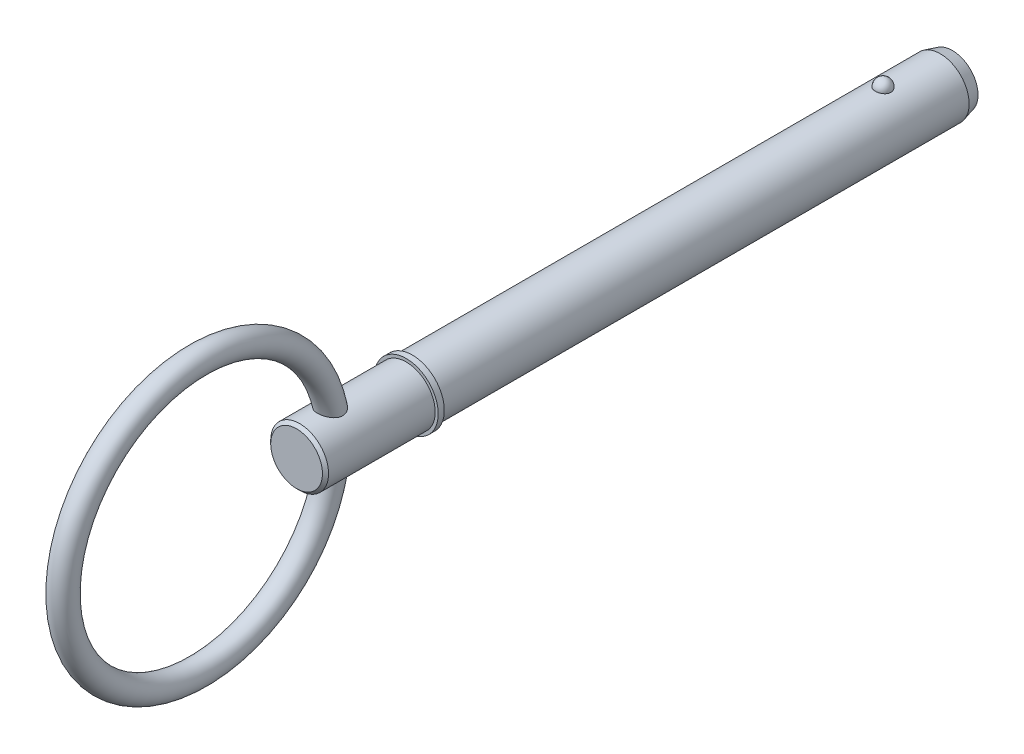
ISO-10303-21;
HEADER;
FILE_DESCRIPTION(('STEP AP214'),'2;1');
FILE_NAME('part.step','',(''),(''),'','','');
FILE_SCHEMA(('AUTOMOTIVE_DESIGN { 1 0 10303 214 1 1 1 1 }'));
ENDSEC;
DATA;
#1=APPLICATION_CONTEXT('core data for automotive mechanical design processes');
#2=APPLICATION_PROTOCOL_DEFINITION('international standard','automotive_design',2000,#1);
#3=PRODUCT_CONTEXT('',#1,'mechanical');
#4=PRODUCT('Part','Part','',(#3));
#5=PRODUCT_RELATED_PRODUCT_CATEGORY('part','',(#4));
#6=PRODUCT_DEFINITION_FORMATION('','',#4);
#7=PRODUCT_DEFINITION_CONTEXT('part definition',#1,'design');
#8=PRODUCT_DEFINITION('design','',#6,#7);
#9=PRODUCT_DEFINITION_SHAPE('','',#8);
#10=(LENGTH_UNIT() NAMED_UNIT(*) SI_UNIT(.MILLI.,.METRE.));
#11=(NAMED_UNIT(*) PLANE_ANGLE_UNIT() SI_UNIT($,.RADIAN.));
#12=(NAMED_UNIT(*) SI_UNIT($,.STERADIAN.) SOLID_ANGLE_UNIT());
#13=UNCERTAINTY_MEASURE_WITH_UNIT(LENGTH_MEASURE(1.E-05),#10,'distance_accuracy_value','');
#14=(GEOMETRIC_REPRESENTATION_CONTEXT(3) GLOBAL_UNCERTAINTY_ASSIGNED_CONTEXT((#13)) GLOBAL_UNIT_ASSIGNED_CONTEXT((#10,
#11,#12)) REPRESENTATION_CONTEXT('',''));
#15=CARTESIAN_POINT('',(0.,0.,0.));
#16=DIRECTION('',(0.,0.,1.));
#17=DIRECTION('',(1.,0.,0.));
#18=AXIS2_PLACEMENT_3D('',#15,#16,#17);
#19=CARTESIAN_POINT('',(0.,0.,76.2));
#20=DIRECTION('',(0.,0.,-1.));
#21=DIRECTION('',(-1.,0.,0.));
#22=AXIS2_PLACEMENT_3D('',#19,#20,#21);
#23=CYLINDRICAL_SURFACE('',#22,4.765);
#24=CARTESIAN_POINT('',(1.27812710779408,4.59038300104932,-1.29));
#25=CARTESIAN_POINT('',(1.27812572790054,4.59038414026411,-1.2178688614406));
#26=CARTESIAN_POINT('',(1.27223018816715,4.59203736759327,-1.14572000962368));
#27=CARTESIAN_POINT('',(1.24878929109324,4.59846646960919,-1.00346315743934));
#28=CARTESIAN_POINT('',(1.23123896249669,4.60324367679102,-0.933356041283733));
#29=CARTESIAN_POINT('',(1.18493861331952,4.61537801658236,-0.797215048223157));
#30=CARTESIAN_POINT('',(1.15619354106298,4.62273400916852,-0.73117938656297));
#31=CARTESIAN_POINT('',(1.08822596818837,4.6392032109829,-0.604986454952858));
#32=CARTESIAN_POINT('',(1.04900384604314,4.64831635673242,-0.544828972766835));
#33=CARTESIAN_POINT('',(0.960865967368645,4.66733302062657,-0.431775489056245));
#34=CARTESIAN_POINT('',(0.911906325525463,4.67723999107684,-0.378914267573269));
#35=CARTESIAN_POINT('',(0.805678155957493,4.69670280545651,-0.282245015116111));
#36=CARTESIAN_POINT('',(0.748409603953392,4.70625864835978,-0.238437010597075));
#37=CARTESIAN_POINT('',(0.627266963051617,4.72392767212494,-0.161207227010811));
#38=CARTESIAN_POINT('',(0.563411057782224,4.73204466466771,-0.127757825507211));
#39=CARTESIAN_POINT('',(0.430755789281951,4.74595788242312,-0.0720471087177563));
#40=CARTESIAN_POINT('',(0.361956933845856,4.75175434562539,-0.0497846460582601));
#41=CARTESIAN_POINT('',(0.222605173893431,4.76030056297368,-0.0173750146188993));
#42=CARTESIAN_POINT('',(0.152101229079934,4.76309991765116,-0.0070303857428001));
#43=CARTESIAN_POINT('',(0.0103009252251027,4.76551622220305,0.00191361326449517));
#44=CARTESIAN_POINT('',(-0.0609953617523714,4.76513345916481,0.000514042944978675));
#45=CARTESIAN_POINT('',(-0.201348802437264,4.76125496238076,-0.0138891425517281));
#46=CARTESIAN_POINT('',(-0.270423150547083,4.75780093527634,-0.0267372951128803));
#47=CARTESIAN_POINT('',(-0.405377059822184,4.74820737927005,-0.0634598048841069));
#48=CARTESIAN_POINT('',(-0.471256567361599,4.74206780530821,-0.0873343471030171));
#49=CARTESIAN_POINT('',(-0.598375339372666,4.72771507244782,-0.145611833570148));
#50=CARTESIAN_POINT('',(-0.659587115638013,4.71949070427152,-0.180071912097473));
#51=CARTESIAN_POINT('',(-0.775356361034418,4.70185936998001,-0.258542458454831));
#52=CARTESIAN_POINT('',(-0.829913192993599,4.69245229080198,-0.302553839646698));
#53=CARTESIAN_POINT('',(-0.931895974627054,4.67327936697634,-0.399829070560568));
#54=CARTESIAN_POINT('',(-0.979176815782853,4.66351011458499,-0.453244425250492));
#55=CARTESIAN_POINT('',(-1.06421220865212,4.64484426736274,-0.56732153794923));
#56=CARTESIAN_POINT('',(-1.10196613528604,4.63594772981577,-0.627983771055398));
#57=CARTESIAN_POINT('',(-1.16735225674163,4.61992036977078,-0.755585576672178));
#58=CARTESIAN_POINT('',(-1.19487251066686,4.61280933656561,-0.822585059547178));
#59=CARTESIAN_POINT('',(-1.23851975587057,4.60128324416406,-0.960417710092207));
#60=CARTESIAN_POINT('',(-1.25464705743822,4.59686811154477,-1.03125077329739));
#61=CARTESIAN_POINT('',(-1.27505790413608,4.59124882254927,-1.17443804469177));
#62=CARTESIAN_POINT('',(-1.27938868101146,4.59003186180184,-1.24678501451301));
#63=CARTESIAN_POINT('',(-1.27623192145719,4.5909105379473,-1.3911989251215));
#64=CARTESIAN_POINT('',(-1.26874468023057,4.59300609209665,-1.46326587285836));
#65=CARTESIAN_POINT('',(-1.24220427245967,4.60025423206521,-1.60473192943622));
#66=CARTESIAN_POINT('',(-1.2232043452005,4.60539274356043,-1.67414176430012));
#67=CARTESIAN_POINT('',(-1.17415910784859,4.61813957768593,-1.80870154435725));
#68=CARTESIAN_POINT('',(-1.1441133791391,4.62574799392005,-1.87385132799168));
#69=CARTESIAN_POINT('',(-1.07354327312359,4.64263368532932,-1.99841604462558));
#70=CARTESIAN_POINT('',(-1.03296580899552,4.65191934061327,-2.05779976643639));
#71=CARTESIAN_POINT('',(-0.942433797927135,4.67110036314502,-2.16881966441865));
#72=CARTESIAN_POINT('',(-0.892478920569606,4.68099575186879,-2.22045556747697));
#73=CARTESIAN_POINT('',(-0.784302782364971,4.70033161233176,-2.31471696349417));
#74=CARTESIAN_POINT('',(-0.726054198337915,4.70977043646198,-2.35731146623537));
#75=CARTESIAN_POINT('',(-0.602997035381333,4.72709995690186,-2.43206620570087));
#76=CARTESIAN_POINT('',(-0.538188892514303,4.73499075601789,-2.46422713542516));
#77=CARTESIAN_POINT('',(-0.404639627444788,4.7482563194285,-2.51687454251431));
#78=CARTESIAN_POINT('',(-0.33595386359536,4.7536596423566,-2.53749415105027));
#79=CARTESIAN_POINT('',(-0.195948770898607,4.76148510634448,-2.56703727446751));
#80=CARTESIAN_POINT('',(-0.124629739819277,4.76390758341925,-2.57596210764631));
#81=CARTESIAN_POINT('',(0.0172696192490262,4.76548774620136,-2.58180339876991));
#82=CARTESIAN_POINT('',(0.0878407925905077,4.76470225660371,-2.57892886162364));
#83=CARTESIAN_POINT('',(0.227467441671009,4.76008019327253,-2.56172603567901));
#84=CARTESIAN_POINT('',(0.296522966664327,4.75624371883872,-2.54739811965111));
#85=CARTESIAN_POINT('',(0.430942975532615,4.74595041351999,-2.50776251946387));
#86=CARTESIAN_POINT('',(0.496319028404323,4.7395023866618,-2.4824917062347));
#87=CARTESIAN_POINT('',(0.621860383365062,4.72467083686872,-2.4216730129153));
#88=CARTESIAN_POINT('',(0.682025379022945,4.71628720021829,-2.38612452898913));
#89=CARTESIAN_POINT('',(0.796409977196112,4.69833598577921,-2.30511163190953));
#90=CARTESIAN_POINT('',(0.850529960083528,4.68875291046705,-2.25951003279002));
#91=CARTESIAN_POINT('',(0.950412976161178,4.66953243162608,-2.15992428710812));
#92=CARTESIAN_POINT('',(0.996174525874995,4.65989501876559,-2.10593865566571));
#93=CARTESIAN_POINT('',(1.07885962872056,4.64145616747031,-1.99009376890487));
#94=CARTESIAN_POINT('',(1.11562789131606,4.63267081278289,-1.92812106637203));
#95=CARTESIAN_POINT('',(1.17840570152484,4.61710269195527,-1.79873681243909));
#96=CARTESIAN_POINT('',(1.20441973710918,4.61031909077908,-1.73132754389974));
#97=CARTESIAN_POINT('',(1.24242116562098,4.60021170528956,-1.60192906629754));
#98=CARTESIAN_POINT('',(1.25578772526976,4.59655387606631,-1.54036674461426));
#99=CARTESIAN_POINT('',(1.27364121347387,4.59163904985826,-1.41587409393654));
#100=CARTESIAN_POINT('',(1.2781283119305,4.59038200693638,-1.35294379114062));
#101=CARTESIAN_POINT('',(1.27812710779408,4.59038300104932,-1.29));
#102=B_SPLINE_CURVE_WITH_KNOTS('',3,(#24,#25,#26,#27,#28,#29,#30,#31,#32,#33,#34,#35,#36,#37,
#38,#39,#40,#41,#42,#43,#44,#45,#46,#47,#48,#49,#50,#51,#52,#53,#54,#55,#56,#57,#58,#59,#60,#61,
#62,#63,#64,#65,#66,#67,#68,#69,#70,#71,#72,#73,#74,#75,#76,#77,#78,#79,#80,#81,#82,#83,#84,#85,
#86,#87,#88,#89,#90,#91,#92,#93,#94,#95,#96,#97,#98,#99,#100,#101),.UNSPECIFIED.,.T.,.F.,(4,2,2,
2,2,2,2,2,2,2,2,2,2,2,2,2,2,2,2,2,2,2,2,2,2,2,2,2,2,2,2,2,2,2,2,2,2,2,4),(0.,0.216167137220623,
0.432426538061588,0.648590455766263,0.864746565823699,1.0818998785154,1.29905382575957,
1.51562361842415,1.73217119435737,1.94507683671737,2.15796327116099,2.36800220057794,
2.57804465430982,2.78924132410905,3.00045819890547,3.21545551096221,3.43046692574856,
3.64776550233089,3.8650581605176,4.08147951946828,4.29789547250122,4.51331818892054,
4.72874907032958,4.94528769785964,5.16183395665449,5.37911087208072,5.59637335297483,
5.8110751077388,6.02575265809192,6.23664413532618,6.44752874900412,6.65770827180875,
6.86790014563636,7.08116060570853,7.29445887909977,7.51121476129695,7.72788009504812,
7.91651762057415,8.10515153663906),.UNSPECIFIED.);
#103=CARTESIAN_POINT('',(1.27812710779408,4.59038300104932,-1.29));
#104=VERTEX_POINT('',#103);
#105=EDGE_CURVE('E101',#104,#104,#102,.T.);
#106=ORIENTED_EDGE('',*,*,#105,.T.);
#107=EDGE_LOOP('',(#106));
#108=FACE_BOUND('',#107,.T.);
#109=CARTESIAN_POINT('',(0.,0.,-10.7));
#110=DIRECTION('',(0.,0.,-1.));
#111=DIRECTION('',(-1.,0.,0.));
#112=AXIS2_PLACEMENT_3D('',#109,#110,#111);
#113=CIRCLE('',#112,4.765);
#114=CARTESIAN_POINT('',(-4.765,0.,-10.7));
#115=VERTEX_POINT('',#114);
#116=EDGE_CURVE('E109',#115,#115,#113,.F.);
#117=ORIENTED_EDGE('',*,*,#116,.T.);
#118=EDGE_LOOP('',(#117));
#119=FACE_BOUND('',#118,.T.);
#120=CARTESIAN_POINT('',(0.,0.,76.2));
#121=DIRECTION('',(0.,0.,1.));
#122=DIRECTION('',(1.,0.,0.));
#123=AXIS2_PLACEMENT_3D('',#120,#121,#122);
#124=CIRCLE('',#123,4.765);
#125=CARTESIAN_POINT('',(4.765,0.,76.2));
#126=VERTEX_POINT('',#125);
#127=EDGE_CURVE('E107',#126,#126,#124,.T.);
#128=ORIENTED_EDGE('',*,*,#127,.F.);
#129=EDGE_LOOP('',(#128));
#130=FACE_BOUND('',#129,.T.);
#131=ADVANCED_FACE('F39',(#108,#119,#130),#23,.T.);
#132=CARTESIAN_POINT('',(0.,0.,-12.7));
#133=DIRECTION('',(0.,0.,-1.));
#134=DIRECTION('',(-1.,0.,0.));
#135=AXIS2_PLACEMENT_3D('',#132,#133,#134);
#136=PLANE('',#135);
#137=CARTESIAN_POINT('',(0.,0.,-12.7));
#138=DIRECTION('',(0.,0.,-1.));
#139=DIRECTION('',(-1.,0.,0.));
#140=AXIS2_PLACEMENT_3D('',#137,#138,#139);
#141=CIRCLE('',#140,4.22910161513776);
#142=CARTESIAN_POINT('',(-4.22910161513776,0.,-12.7));
#143=VERTEX_POINT('',#142);
#144=EDGE_CURVE('E143',#143,#143,#141,.T.);
#145=ORIENTED_EDGE('',*,*,#144,.T.);
#146=EDGE_LOOP('',(#145));
#147=FACE_BOUND('',#146,.T.);
#148=ADVANCED_FACE('F87',(#147),#136,.T.);
#149=CARTESIAN_POINT('',(0.,0.,-12.7));
#150=DIRECTION('',(0.,0.,1.));
#151=DIRECTION('',(1.,0.,0.));
#152=AXIS2_PLACEMENT_3D('',#149,#150,#151);
#153=CONICAL_SURFACE('',#152,4.22910161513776,0.261799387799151);
#154=ORIENTED_EDGE('',*,*,#116,.F.);
#155=EDGE_LOOP('',(#154));
#156=FACE_BOUND('',#155,.T.);
#157=ORIENTED_EDGE('',*,*,#144,.F.);
#158=EDGE_LOOP('',(#157));
#159=FACE_BOUND('',#158,.T.);
#160=ADVANCED_FACE('F93',(#156,#159),#153,.T.);
#161=CARTESIAN_POINT('',(0.,4.765,-1.29));
#162=DIRECTION('',(0.,1.,0.));
#163=DIRECTION('',(0.,0.,-1.));
#164=AXIS2_PLACEMENT_3D('',#161,#162,#163);
#165=SPHERICAL_SURFACE('',#164,1.29);
#166=ORIENTED_EDGE('',*,*,#105,.F.);
#167=EDGE_LOOP('',(#166));
#168=FACE_BOUND('',#167,.T.);
#169=ADVANCED_FACE('F112',(#168),#165,.T.);
#170=CARTESIAN_POINT('',(0.,0.,76.2));
#171=DIRECTION('',(0.,0.,-1.));
#172=DIRECTION('',(-1.,0.,0.));
#173=AXIS2_PLACEMENT_3D('',#170,#171,#172);
#174=PLANE('',#173);
#175=ORIENTED_EDGE('',*,*,#127,.T.);
#176=EDGE_LOOP('',(#175));
#177=FACE_BOUND('',#176,.T.);
#178=CARTESIAN_POINT('',(0.,0.,76.2));
#179=DIRECTION('',(0.,0.,-1.));
#180=DIRECTION('',(-1.,0.,0.));
#181=AXIS2_PLACEMENT_3D('',#178,#179,#180);
#182=CIRCLE('',#181,5.265);
#183=CARTESIAN_POINT('',(-5.265,0.,76.2));
#184=VERTEX_POINT('',#183);
#185=EDGE_CURVE('E108',#184,#184,#182,.T.);
#186=ORIENTED_EDGE('',*,*,#185,.T.);
#187=EDGE_LOOP('',(#186));
#188=FACE_BOUND('',#187,.T.);
#189=ADVANCED_FACE('F116',(#177,#188),#174,.T.);
#190=CARTESIAN_POINT('',(0.,0.,33.7287874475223));
#191=DIRECTION('',(0.,0.,-1.));
#192=DIRECTION('',(-1.,0.,0.));
#193=AXIS2_PLACEMENT_3D('',#190,#191,#192);
#194=CYLINDRICAL_SURFACE('',#193,5.265);
#195=CARTESIAN_POINT('',(0.,0.,77.2));
#196=DIRECTION('',(0.,0.,-1.));
#197=DIRECTION('',(-1.,0.,0.));
#198=AXIS2_PLACEMENT_3D('',#195,#196,#197);
#199=CIRCLE('',#198,5.265);
#200=CARTESIAN_POINT('',(-5.265,0.,77.2));
#201=VERTEX_POINT('',#200);
#202=EDGE_CURVE('E133',#201,#201,#199,.T.);
#203=ORIENTED_EDGE('',*,*,#202,.T.);
#204=EDGE_LOOP('',(#203));
#205=FACE_BOUND('',#204,.T.);
#206=ORIENTED_EDGE('',*,*,#185,.F.);
#207=EDGE_LOOP('',(#206));
#208=FACE_BOUND('',#207,.T.);
#209=ADVANCED_FACE('F120',(#205,#208),#194,.T.);
#210=CARTESIAN_POINT('',(0.,5.265,77.2));
#211=DIRECTION('',(0.,0.,1.));
#212=DIRECTION('',(1.,0.,0.));
#213=AXIS2_PLACEMENT_3D('',#210,#211,#212);
#214=PLANE('',#213);
#215=CARTESIAN_POINT('',(0.,0.,77.2));
#216=DIRECTION('',(0.,0.,1.));
#217=DIRECTION('',(1.,0.,0.));
#218=AXIS2_PLACEMENT_3D('',#215,#216,#217);
#219=CIRCLE('',#218,4.765);
#220=CARTESIAN_POINT('',(4.765,0.,77.2));
#221=VERTEX_POINT('',#220);
#222=EDGE_CURVE('E111',#221,#221,#219,.T.);
#223=ORIENTED_EDGE('',*,*,#222,.F.);
#224=EDGE_LOOP('',(#223));
#225=FACE_BOUND('',#224,.T.);
#226=ORIENTED_EDGE('',*,*,#202,.F.);
#227=EDGE_LOOP('',(#226));
#228=FACE_BOUND('',#227,.T.);
#229=ADVANCED_FACE('F84',(#225,#228),#214,.T.);
#230=CARTESIAN_POINT('',(0.,0.,95.25));
#231=DIRECTION('',(0.,0.,-1.));
#232=DIRECTION('',(-1.,0.,0.));
#233=AXIS2_PLACEMENT_3D('',#230,#231,#232);
#234=CYLINDRICAL_SURFACE('',#233,4.765);
#235=CARTESIAN_POINT('',(-1.17603588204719,-4.61759294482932,88.0837200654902));
#236=CARTESIAN_POINT('',(-1.08605054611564,-4.6405075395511,88.0215688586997));
#237=CARTESIAN_POINT('',(-0.990486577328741,-4.66202408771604,87.9667393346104));
#238=CARTESIAN_POINT('',(-0.79076273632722,-4.70002969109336,87.8729957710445));
#239=CARTESIAN_POINT('',(-0.686587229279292,-4.7165093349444,87.8341114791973));
#240=CARTESIAN_POINT('',(-0.472539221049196,-4.7427361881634,87.773267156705));
#241=CARTESIAN_POINT('',(-0.362665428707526,-4.7524818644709,87.7513109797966));
#242=CARTESIAN_POINT('',(-0.140482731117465,-4.7642267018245,87.7249366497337));
#243=CARTESIAN_POINT('',(-0.0281752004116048,-4.7662301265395,87.7205088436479));
#244=CARTESIAN_POINT('',(0.193745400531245,-4.76233166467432,87.7292082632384));
#245=CARTESIAN_POINT('',(0.303372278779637,-4.75656024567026,87.7420457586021));
#246=CARTESIAN_POINT('',(0.518724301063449,-4.73791484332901,87.7844340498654));
#247=CARTESIAN_POINT('',(0.624448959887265,-4.72503997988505,87.8139869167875));
#248=CARTESIAN_POINT('',(0.829434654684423,-4.69340588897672,87.8892085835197));
#249=CARTESIAN_POINT('',(0.928674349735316,-4.6746283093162,87.9349277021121));
#250=CARTESIAN_POINT('',(1.11777413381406,-4.6330539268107,88.0414733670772));
#251=CARTESIAN_POINT('',(1.20763216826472,-4.61025624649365,88.1023032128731));
#252=CARTESIAN_POINT('',(1.37762760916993,-4.56238439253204,88.2394393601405));
#253=CARTESIAN_POINT('',(1.45749020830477,-4.53726959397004,88.3160728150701));
#254=CARTESIAN_POINT('',(1.60275140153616,-4.48801828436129,88.4822939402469));
#255=CARTESIAN_POINT('',(1.66815155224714,-4.46388166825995,88.571880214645));
#256=CARTESIAN_POINT('',(1.78162069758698,-4.41980966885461,88.7604689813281));
#257=CARTESIAN_POINT('',(1.82993675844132,-4.3998162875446,88.8593086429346));
#258=CARTESIAN_POINT('',(1.90902953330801,-4.36608532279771,89.0647395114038));
#259=CARTESIAN_POINT('',(1.93981696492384,-4.35234391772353,89.1713259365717));
#260=CARTESIAN_POINT('',(1.9818112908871,-4.33337618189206,89.382380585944));
#261=CARTESIAN_POINT('',(1.99406945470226,-4.32769391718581,89.48660066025));
#262=CARTESIAN_POINT('',(2.0025484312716,-4.32377679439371,89.6958125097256));
#263=CARTESIAN_POINT('',(1.99876733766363,-4.32554282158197,89.8008043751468));
#264=CARTESIAN_POINT('',(1.97595504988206,-4.33600911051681,90.0091056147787));
#265=CARTESIAN_POINT('',(1.95686739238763,-4.3447350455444,90.1124073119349));
#266=CARTESIAN_POINT('',(1.90457346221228,-4.36790947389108,90.3146792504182));
#267=CARTESIAN_POINT('',(1.87136191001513,-4.38236010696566,90.4136478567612));
#268=CARTESIAN_POINT('',(1.78747856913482,-4.41728816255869,90.6164706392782));
#269=CARTESIAN_POINT('',(1.73524632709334,-4.43826528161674,90.7195927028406));
#270=CARTESIAN_POINT('',(1.61607256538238,-4.48303292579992,90.9163865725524));
#271=CARTESIAN_POINT('',(1.5491157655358,-4.50682636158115,91.0100484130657));
#272=CARTESIAN_POINT('',(1.39359064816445,-4.55746895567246,91.1953838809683));
#273=CARTESIAN_POINT('',(1.30346928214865,-4.58437060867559,91.2857503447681));
#274=CARTESIAN_POINT('',(1.10794390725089,-4.6354985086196,91.4490111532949));
#275=CARTESIAN_POINT('',(1.00255934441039,-4.65972809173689,91.5219274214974));
#276=CARTESIAN_POINT('',(0.803761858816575,-4.69755503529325,91.6324077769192));
#277=CARTESIAN_POINT('',(0.712935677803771,-4.71231838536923,91.6742306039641));
#278=CARTESIAN_POINT('',(0.525172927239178,-4.73691370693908,91.7429362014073));
#279=CARTESIAN_POINT('',(0.428242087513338,-4.74675022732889,91.7698327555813));
#280=CARTESIAN_POINT('',(0.230351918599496,-4.76046566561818,91.8071470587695));
#281=CARTESIAN_POINT('',(0.129376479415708,-4.76431768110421,91.8174904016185));
#282=CARTESIAN_POINT('',(-0.0728965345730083,-4.76551495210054,91.8207168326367));
#283=CARTESIAN_POINT('',(-0.174194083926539,-4.76286070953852,91.8136012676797));
#284=CARTESIAN_POINT('',(-0.366467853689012,-4.751792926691,91.7835798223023));
#285=CARTESIAN_POINT('',(-0.457659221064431,-4.74381187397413,91.7618588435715));
#286=CARTESIAN_POINT('',(-0.635226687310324,-4.72331548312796,91.7050844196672));
#287=CARTESIAN_POINT('',(-0.72160169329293,-4.71079912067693,91.6700279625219));
#288=CARTESIAN_POINT('',(-0.893212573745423,-4.68139468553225,91.5855597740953));
#289=CARTESIAN_POINT('',(-0.978027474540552,-4.66427939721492,91.5353775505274));
#290=CARTESIAN_POINT('',(-1.13917803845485,-4.62756330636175,91.4236420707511));
#291=CARTESIAN_POINT('',(-1.21550961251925,-4.60796131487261,91.3620833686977));
#292=CARTESIAN_POINT('',(-1.37033540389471,-4.56452178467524,91.2186885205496));
#293=CARTESIAN_POINT('',(-1.44723650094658,-4.5405070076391,91.1351843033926));
#294=CARTESIAN_POINT('',(-1.58763850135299,-4.49334232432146,90.9572920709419));
#295=CARTESIAN_POINT('',(-1.65112672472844,-4.47019325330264,90.8628938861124));
#296=CARTESIAN_POINT('',(-1.77033243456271,-4.42444393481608,90.6532060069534));
#297=CARTESIAN_POINT('',(-1.82420433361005,-4.40224259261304,90.5367685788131));
#298=CARTESIAN_POINT('',(-1.9116908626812,-4.36496831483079,90.2954090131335));
#299=CARTESIAN_POINT('',(-1.94531523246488,-4.3498919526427,90.1704909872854));
#300=CARTESIAN_POINT('',(-1.98892523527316,-4.33012255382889,89.9220163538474));
#301=CARTESIAN_POINT('',(-1.99998275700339,-4.32495941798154,89.7986899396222));
#302=CARTESIAN_POINT('',(-2.00001713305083,-4.32494814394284,89.552073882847));
#303=CARTESIAN_POINT('',(-1.98902141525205,-4.33008719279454,89.4287843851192));
#304=CARTESIAN_POINT('',(-1.94752572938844,-4.34888267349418,89.20321378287));
#305=CARTESIAN_POINT('',(-1.91979754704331,-4.36132278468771,89.1003106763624));
#306=CARTESIAN_POINT('',(-1.8480559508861,-4.39220107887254,88.9012512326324));
#307=CARTESIAN_POINT('',(-1.80403476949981,-4.4106421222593,88.8050981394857));
#308=CARTESIAN_POINT('',(-1.7023200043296,-4.4508689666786,88.6244579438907));
#309=CARTESIAN_POINT('',(-1.64499853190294,-4.47255887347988,88.5397380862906));
#310=CARTESIAN_POINT('',(-1.51770958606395,-4.51733419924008,88.381012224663));
#311=CARTESIAN_POINT('',(-1.44776268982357,-4.54041730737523,88.3069891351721));
#312=CARTESIAN_POINT('',(-1.34143544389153,-4.57239833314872,88.21104340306));
#313=CARTESIAN_POINT('',(-1.30955259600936,-4.58164274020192,88.1841153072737));
#314=CARTESIAN_POINT('',(-1.24406394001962,-4.59985727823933,88.1323409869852));
#315=CARTESIAN_POINT('',(-1.21045807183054,-4.6088273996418,88.1074948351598));
#316=CARTESIAN_POINT('',(-1.17603588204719,-4.61759294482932,88.0837200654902));
#317=B_SPLINE_CURVE_WITH_KNOTS('',3,(#235,#236,#237,#238,#239,#240,#241,#242,#243,#244,#245,
#246,#247,#248,#249,#250,#251,#252,#253,#254,#255,#256,#257,#258,#259,#260,#261,#262,#263,#264,
#265,#266,#267,#268,#269,#270,#271,#272,#273,#274,#275,#276,#277,#278,#279,#280,#281,#282,#283,
#284,#285,#286,#287,#288,#289,#290,#291,#292,#293,#294,#295,#296,#297,#298,#299,#300,#301,#302,
#303,#304,#305,#306,#307,#308,#309,#310,#311,#312,#313,#314,#315,#316),.UNSPECIFIED.,.T.,.F.,(4,
2,2,2,2,2,2,2,2,2,2,2,2,2,2,2,2,2,2,2,2,2,2,2,2,2,2,2,2,2,2,2,2,2,2,2,2,2,2,2,4),(0.,
0.335054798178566,0.670731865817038,1.00648532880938,1.3420538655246,1.67206089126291,
2.00210881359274,2.33319321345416,2.66434996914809,3.00321157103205,3.34203668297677,
3.67573940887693,4.00923787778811,4.32299322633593,4.63678586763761,4.95174139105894,
5.26681474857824,5.61785759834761,5.96926647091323,6.35862694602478,6.74749565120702,
7.04947204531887,7.35116911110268,7.65421852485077,7.95724456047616,8.23825252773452,
8.51932400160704,8.81825171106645,9.11732288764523,9.46404422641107,9.81109188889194,
10.1997682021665,10.5882573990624,10.9578189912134,11.32692124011,11.6472091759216,
11.9676500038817,12.2800235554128,12.5918925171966,12.7200569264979,12.8482258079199),.UNSPECIFIED.);
#318=CARTESIAN_POINT('',(-1.17603588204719,-4.61759294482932,88.0837200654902));
#319=VERTEX_POINT('',#318);
#320=EDGE_CURVE('E10',#319,#319,#317,.T.);
#321=ORIENTED_EDGE('',*,*,#320,.F.);
#322=EDGE_LOOP('',(#321));
#323=FACE_BOUND('',#322,.T.);
#324=CARTESIAN_POINT('',(-1.17603588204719,4.61759294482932,88.0837200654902));
#325=CARTESIAN_POINT('',(-1.26499234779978,4.59493450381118,88.1451699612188));
#326=CARTESIAN_POINT('',(-1.34870034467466,4.57085993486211,88.2139152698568));
#327=CARTESIAN_POINT('',(-1.50334626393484,4.52236448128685,88.364635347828));
#328=CARTESIAN_POINT('',(-1.57425996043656,4.49794303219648,88.4466346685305));
#329=CARTESIAN_POINT('',(-1.7013018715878,4.45144771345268,88.6222345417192));
#330=CARTESIAN_POINT('',(-1.75740699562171,4.42937754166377,88.7158528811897));
#331=CARTESIAN_POINT('',(-1.85287755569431,4.39030189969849,88.9121668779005));
#332=CARTESIAN_POINT('',(-1.89225871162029,4.37329167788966,89.0148539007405));
#333=CARTESIAN_POINT('',(-1.95188661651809,4.34699775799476,89.2218576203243));
#334=CARTESIAN_POINT('',(-1.97286468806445,4.33742068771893,89.3259265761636));
#335=CARTESIAN_POINT('',(-1.99814509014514,4.32583397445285,89.5364714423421));
#336=CARTESIAN_POINT('',(-2.00244696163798,4.32382453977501,89.6429474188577));
#337=CARTESIAN_POINT('',(-1.99499900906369,4.32726361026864,89.8527706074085));
#338=CARTESIAN_POINT('',(-1.9836061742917,4.33254625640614,89.956134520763));
#339=CARTESIAN_POINT('',(-1.94643618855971,4.34936983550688,90.1596911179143));
#340=CARTESIAN_POINT('',(-1.92065444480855,4.3609127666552,90.2598827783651));
#341=CARTESIAN_POINT('',(-1.85292379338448,4.3901452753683,90.4641042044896));
#342=CARTESIAN_POINT('',(-1.80971134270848,4.40830066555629,90.5676462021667));
#343=CARTESIAN_POINT('',(-1.70892742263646,4.44833985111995,90.7667684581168));
#344=CARTESIAN_POINT('',(-1.65134284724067,4.47022704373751,90.8623413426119));
#345=CARTESIAN_POINT('',(-1.51475300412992,4.51847764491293,91.0552600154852));
#346=CARTESIAN_POINT('',(-1.43395667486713,4.54505660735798,91.1512914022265));
#347=CARTESIAN_POINT('',(-1.25684082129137,4.59718102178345,91.3281328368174));
#348=CARTESIAN_POINT('',(-1.16053129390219,4.62272712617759,91.4089526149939));
#349=CARTESIAN_POINT('',(-0.972192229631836,4.66558476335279,91.5393265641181));
#350=CARTESIAN_POINT('',(-0.882391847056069,4.68355428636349,91.5918799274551));
#351=CARTESIAN_POINT('',(-0.694836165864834,4.71502283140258,91.6820221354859));
#352=CARTESIAN_POINT('',(-0.597087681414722,4.72852563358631,91.7196236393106));
#353=CARTESIAN_POINT('',(-0.39532174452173,4.74966109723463,91.7778751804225));
#354=CARTESIAN_POINT('',(-0.291269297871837,4.7572569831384,91.7984190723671));
#355=CARTESIAN_POINT('',(-0.0808979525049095,4.76547327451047,91.8206246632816));
#356=CARTESIAN_POINT('',(0.0254198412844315,4.76609700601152,91.8222953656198));
#357=CARTESIAN_POINT('',(0.225327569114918,4.7606097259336,91.8074850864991));
#358=CARTESIAN_POINT('',(0.319084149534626,4.75519734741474,91.7928871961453));
#359=CARTESIAN_POINT('',(0.502750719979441,4.73930039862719,91.7493972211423));
#360=CARTESIAN_POINT('',(0.592660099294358,4.7288150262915,91.720502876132));
#361=CARTESIAN_POINT('',(0.7687773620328,4.70343779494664,91.6490413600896));
#362=CARTESIAN_POINT('',(0.854839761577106,4.68844387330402,91.6061552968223));
#363=CARTESIAN_POINT('',(1.01943666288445,4.65543047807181,91.5087469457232));
#364=CARTESIAN_POINT('',(1.09796821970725,4.63740982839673,91.4542201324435));
#365=CARTESIAN_POINT('',(1.25751825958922,4.59691257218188,91.3264656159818));
#366=CARTESIAN_POINT('',(1.33721103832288,4.57417011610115,91.2516678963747));
#367=CARTESIAN_POINT('',(1.48461190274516,4.52847869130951,91.0910829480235));
#368=CARTESIAN_POINT('',(1.55230949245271,4.50552956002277,91.0052862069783));
#369=CARTESIAN_POINT('',(1.68366050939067,4.45825797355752,90.8114045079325));
#370=CARTESIAN_POINT('',(1.74532014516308,4.43421533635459,90.7018899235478));
#371=CARTESIAN_POINT('',(1.85007805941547,4.39154308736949,90.4732696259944));
#372=CARTESIAN_POINT('',(1.89317429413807,4.37291407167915,90.3541628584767));
#373=CARTESIAN_POINT('',(1.958572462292,4.34402041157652,90.1097631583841));
#374=CARTESIAN_POINT('',(1.98095022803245,4.33372528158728,89.984494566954));
#375=CARTESIAN_POINT('',(2.00301292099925,4.32358016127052,89.7315942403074));
#376=CARTESIAN_POINT('',(2.00273000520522,4.32371536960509,89.6039661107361));
#377=CARTESIAN_POINT('',(1.97997568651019,4.3341693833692,89.3682474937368));
#378=CARTESIAN_POINT('',(1.96044562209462,4.34313814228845,89.2598066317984));
#379=CARTESIAN_POINT('',(1.90368145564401,4.36831534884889,89.0485431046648));
#380=CARTESIAN_POINT('',(1.86644884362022,4.38452318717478,88.9457199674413));
#381=CARTESIAN_POINT('',(1.7781154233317,4.42104679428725,88.7547100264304));
#382=CARTESIAN_POINT('',(1.72797707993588,4.44105894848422,88.6660156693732));
#383=CARTESIAN_POINT('',(1.61439500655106,4.48359504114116,88.4982868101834));
#384=CARTESIAN_POINT('',(1.55094927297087,4.50611935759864,88.4192537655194));
#385=CARTESIAN_POINT('',(1.40889349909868,4.55259151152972,88.2687053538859));
#386=CARTESIAN_POINT('',(1.32968750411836,4.57655455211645,88.1977571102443));
#387=CARTESIAN_POINT('',(1.16035884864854,4.62238936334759,88.0695060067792));
#388=CARTESIAN_POINT('',(1.07023361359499,4.64426063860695,88.0122063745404));
#389=CARTESIAN_POINT('',(0.877362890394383,4.68460759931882,87.9103166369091));
#390=CARTESIAN_POINT('',(0.774249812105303,4.70290564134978,87.8663495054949));
#391=CARTESIAN_POINT('',(0.561430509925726,4.73302876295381,87.7954843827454));
#392=CARTESIAN_POINT('',(0.451725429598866,4.74485496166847,87.7685834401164));
#393=CARTESIAN_POINT('',(0.230282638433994,4.76071009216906,87.7327633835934));
#394=CARTESIAN_POINT('',(0.118587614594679,4.76483485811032,87.7236232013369));
#395=CARTESIAN_POINT('',(-0.104911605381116,4.76515532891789,87.7229082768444));
#396=CARTESIAN_POINT('',(-0.216715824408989,4.76134861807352,87.7313388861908));
#397=CARTESIAN_POINT('',(-0.435231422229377,4.74632552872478,87.7652456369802));
#398=CARTESIAN_POINT('',(-0.541996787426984,4.73523460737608,87.7904332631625));
#399=CARTESIAN_POINT('',(-0.749371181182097,4.70686626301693,87.8569215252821));
#400=CARTESIAN_POINT('',(-0.849990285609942,4.68959930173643,87.8981949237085));
#401=CARTESIAN_POINT('',(-0.986108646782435,4.6620261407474,87.9672359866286));
#402=CARTESIAN_POINT('',(-1.02525769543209,4.65355983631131,87.9887724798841));
#403=CARTESIAN_POINT('',(-1.10191286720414,4.63600664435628,88.0343673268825));
#404=CARTESIAN_POINT('',(-1.13941901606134,4.62691976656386,88.058425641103));
#405=CARTESIAN_POINT('',(-1.17603588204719,4.61759294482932,88.0837200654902));
#406=B_SPLINE_CURVE_WITH_KNOTS('',3,(#324,#325,#326,#327,#328,#329,#330,#331,#332,#333,#334,
#335,#336,#337,#338,#339,#340,#341,#342,#343,#344,#345,#346,#347,#348,#349,#350,#351,#352,#353,
#354,#355,#356,#357,#358,#359,#360,#361,#362,#363,#364,#365,#366,#367,#368,#369,#370,#371,#372,
#373,#374,#375,#376,#377,#378,#379,#380,#381,#382,#383,#384,#385,#386,#387,#388,#389,#390,#391,
#392,#393,#394,#395,#396,#397,#398,#399,#400,#401,#402,#403,#404,#405),.UNSPECIFIED.,.T.,.F.,(4,
2,2,2,2,2,2,2,2,2,2,2,2,2,2,2,2,2,2,2,2,2,2,2,2,2,2,2,2,2,2,2,2,2,2,2,2,2,2,2,4),(0.,
0.331234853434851,0.66309046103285,0.995460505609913,1.3275174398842,1.64568783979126,
1.96386699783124,2.27492717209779,2.5860866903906,2.92571998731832,3.26566413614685,
3.64875195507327,4.03159388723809,4.34706664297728,4.66227172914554,4.97942386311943,
5.29642469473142,5.58021908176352,5.86405835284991,6.15488068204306,6.44581627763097,
6.77943874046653,7.11335170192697,7.49545660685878,7.87760356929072,8.25834622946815,
8.63854860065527,8.96843568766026,9.29829501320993,9.60842872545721,9.91860916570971,
10.2441707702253,10.5698092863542,10.9089029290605,11.2479379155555,11.5827251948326,
11.9176144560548,12.2468820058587,12.5755944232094,12.7119417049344,12.8482868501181),.UNSPECIFIED.);
#407=CARTESIAN_POINT('',(-1.17603588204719,4.61759294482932,88.0837200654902));
#408=VERTEX_POINT('',#407);
#409=EDGE_CURVE('E51',#408,#408,#406,.T.);
#410=ORIENTED_EDGE('',*,*,#409,.F.);
#411=EDGE_LOOP('',(#410));
#412=FACE_BOUND('',#411,.T.);
#413=CARTESIAN_POINT('',(0.,0.,94.7499999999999));
#414=DIRECTION('',(0.,0.,-1.));
#415=DIRECTION('',(-1.,0.,0.));
#416=AXIS2_PLACEMENT_3D('',#413,#414,#415);
#417=CIRCLE('',#416,4.765);
#418=CARTESIAN_POINT('',(-4.765,0.,94.7499999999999));
#419=VERTEX_POINT('',#418);
#420=EDGE_CURVE('E63',#419,#419,#417,.T.);
#421=ORIENTED_EDGE('',*,*,#420,.T.);
#422=EDGE_LOOP('',(#421));
#423=FACE_BOUND('',#422,.T.);
#424=ORIENTED_EDGE('',*,*,#222,.T.);
#425=EDGE_LOOP('',(#424));
#426=FACE_BOUND('',#425,.T.);
#427=ADVANCED_FACE('F68',(#323,#412,#423,#426),#234,.T.);
#428=CARTESIAN_POINT('',(0.,0.,95.25));
#429=DIRECTION('',(0.,0.,-1.));
#430=DIRECTION('',(-1.,0.,0.));
#431=AXIS2_PLACEMENT_3D('',#428,#429,#430);
#432=PLANE('',#431);
#433=CARTESIAN_POINT('',(0.,0.,95.25));
#434=DIRECTION('',(0.,0.,-1.));
#435=DIRECTION('',(-1.,0.,0.));
#436=AXIS2_PLACEMENT_3D('',#433,#434,#435);
#437=CIRCLE('',#436,4.26499999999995);
#438=CARTESIAN_POINT('',(-4.26499999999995,0.,95.25));
#439=VERTEX_POINT('',#438);
#440=EDGE_CURVE('E58',#439,#439,#437,.F.);
#441=ORIENTED_EDGE('',*,*,#440,.T.);
#442=EDGE_LOOP('',(#441));
#443=FACE_BOUND('',#442,.T.);
#444=ADVANCED_FACE('F75',(#443),#432,.F.);
#445=CARTESIAN_POINT('',(0.,0.,94.7499999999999));
#446=DIRECTION('',(0.,0.,-1.));
#447=DIRECTION('',(-1.,0.,0.));
#448=AXIS2_PLACEMENT_3D('',#445,#446,#447);
#449=CONICAL_SURFACE('',#448,4.765,0.785398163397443);
#450=ORIENTED_EDGE('',*,*,#440,.F.);
#451=EDGE_LOOP('',(#450));
#452=FACE_BOUND('',#451,.T.);
#453=ORIENTED_EDGE('',*,*,#420,.F.);
#454=EDGE_LOOP('',(#453));
#455=FACE_BOUND('',#454,.T.);
#456=ADVANCED_FACE('F41',(#452,#455),#449,.T.);
#457=CARTESIAN_POINT('',(0.,0.,111.475));
#458=DIRECTION('',(1.,0.,0.));
#459=DIRECTION('',(0.,0.,-1.));
#460=AXIS2_PLACEMENT_3D('',#457,#458,#459);
#461=TOROIDAL_SURFACE('',#460,22.225,2.);
#462=ORIENTED_EDGE('',*,*,#320,.T.);
#463=EDGE_LOOP('',(#462));
#464=FACE_BOUND('',#463,.T.);
#465=ORIENTED_EDGE('',*,*,#409,.T.);
#466=EDGE_LOOP('',(#465));
#467=FACE_BOUND('',#466,.T.);
#468=ADVANCED_FACE('F72',(#464,#467),#461,.T.);
#469=CLOSED_SHELL('',(#131,#148,#160,#169,#189,#209,#229,#427,#444,#456,#468));
#470=MANIFOLD_SOLID_BREP('B2',#469);
#471=ADVANCED_BREP_SHAPE_REPRESENTATION('',(#18,#470),#14);
#472=SHAPE_DEFINITION_REPRESENTATION(#9,#471);
ENDSEC;
END-ISO-10303-21;
